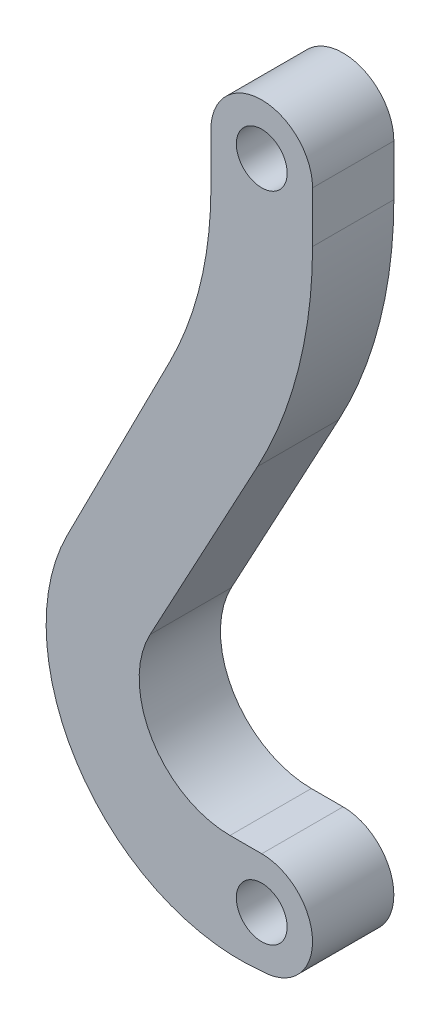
ISO-10303-21;
HEADER;
FILE_DESCRIPTION(('STEP AP214'),'2;1');
FILE_NAME('part.step','',(''),(''),'','','');
FILE_SCHEMA(('AUTOMOTIVE_DESIGN { 1 0 10303 214 1 1 1 1 }'));
ENDSEC;
DATA;
#1=APPLICATION_CONTEXT('core data for automotive mechanical design processes');
#2=APPLICATION_PROTOCOL_DEFINITION('international standard','automotive_design',2000,#1);
#3=PRODUCT_CONTEXT('',#1,'mechanical');
#4=PRODUCT('Part','Part','',(#3));
#5=PRODUCT_RELATED_PRODUCT_CATEGORY('part','',(#4));
#6=PRODUCT_DEFINITION_FORMATION('','',#4);
#7=PRODUCT_DEFINITION_CONTEXT('part definition',#1,'design');
#8=PRODUCT_DEFINITION('design','',#6,#7);
#9=PRODUCT_DEFINITION_SHAPE('','',#8);
#10=(LENGTH_UNIT() NAMED_UNIT(*) SI_UNIT(.MILLI.,.METRE.));
#11=(NAMED_UNIT(*) PLANE_ANGLE_UNIT() SI_UNIT($,.RADIAN.));
#12=(NAMED_UNIT(*) SI_UNIT($,.STERADIAN.) SOLID_ANGLE_UNIT());
#13=UNCERTAINTY_MEASURE_WITH_UNIT(LENGTH_MEASURE(1.E-05),#10,'distance_accuracy_value','');
#14=(GEOMETRIC_REPRESENTATION_CONTEXT(3) GLOBAL_UNCERTAINTY_ASSIGNED_CONTEXT((#13)) GLOBAL_UNIT_ASSIGNED_CONTEXT((#10,
#11,#12)) REPRESENTATION_CONTEXT('',''));
#15=CARTESIAN_POINT('',(0.,0.,0.));
#16=DIRECTION('',(0.,0.,1.));
#17=DIRECTION('',(1.,0.,0.));
#18=AXIS2_PLACEMENT_3D('',#15,#16,#17);
#19=CARTESIAN_POINT('',(1.,12.85,1.6));
#20=DIRECTION('',(0.,0.,-1.));
#21=DIRECTION('',(-1.,0.,0.));
#22=AXIS2_PLACEMENT_3D('',#19,#20,#21);
#23=PLANE('',#22);
#24=CARTESIAN_POINT('',(1.,12.85,1.6));
#25=DIRECTION('',(0.,0.,1.));
#26=DIRECTION('',(1.,0.,0.));
#27=AXIS2_PLACEMENT_3D('',#24,#25,#26);
#28=CIRCLE('',#27,0.500000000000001);
#29=CARTESIAN_POINT('',(1.5,12.85,1.6));
#30=VERTEX_POINT('',#29);
#31=EDGE_CURVE('E153',#30,#30,#28,.T.);
#32=ORIENTED_EDGE('',*,*,#31,.F.);
#33=EDGE_LOOP('',(#32));
#34=FACE_BOUND('',#33,.T.);
#35=CARTESIAN_POINT('',(1.,12.85,1.6));
#36=DIRECTION('',(0.,0.,1.));
#37=DIRECTION('',(-1.,0.,0.));
#38=AXIS2_PLACEMENT_3D('',#35,#36,#37);
#39=CIRCLE('',#38,1.);
#40=CARTESIAN_POINT('',(2.,12.85,1.6));
#41=VERTEX_POINT('',#40);
#42=CARTESIAN_POINT('',(0.,12.85,1.6));
#43=VERTEX_POINT('',#42);
#44=EDGE_CURVE('E170',#41,#43,#39,.T.);
#45=ORIENTED_EDGE('',*,*,#44,.T.);
#46=DIRECTION('',(0.,-1.,0.));
#47=VECTOR('',#46,1.);
#48=CARTESIAN_POINT('',(0.,12.85,1.6));
#49=LINE('',#48,#47);
#50=CARTESIAN_POINT('',(0.,11.8491991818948,1.6));
#51=VERTEX_POINT('',#50);
#52=EDGE_CURVE('E103',#43,#51,#49,.T.);
#53=ORIENTED_EDGE('',*,*,#52,.T.);
#54=CARTESIAN_POINT('',(-7.41008545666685,11.8491991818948,1.6));
#55=DIRECTION('',(0.,0.,-1.));
#56=DIRECTION('',(-1.,0.,0.));
#57=AXIS2_PLACEMENT_3D('',#54,#55,#56);
#58=CIRCLE('',#57,7.41008545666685);
#59=CARTESIAN_POINT('',(-0.806454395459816,8.48744022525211,1.6));
#60=VERTEX_POINT('',#59);
#61=EDGE_CURVE('E194',#51,#60,#58,.T.);
#62=ORIENTED_EDGE('',*,*,#61,.T.);
#63=DIRECTION('',(-0.453673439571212,-0.891168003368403,0.));
#64=VECTOR('',#63,1.);
#65=CARTESIAN_POINT('',(-0.806454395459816,8.48744022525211,1.6));
#66=LINE('',#65,#64);
#67=CARTESIAN_POINT('',(-2.82824737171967,4.5159553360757,1.6));
#68=VERTEX_POINT('',#67);
#69=EDGE_CURVE('E213',#60,#68,#66,.T.);
#70=ORIENTED_EDGE('',*,*,#69,.T.);
#71=CARTESIAN_POINT('',(0.568319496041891,2.7868400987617,1.6));
#72=DIRECTION('',(0.,0.,1.));
#73=DIRECTION('',(1.,0.,0.));
#74=AXIS2_PLACEMENT_3D('',#71,#72,#73);
#75=CIRCLE('',#74,3.81136537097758);
#76=CARTESIAN_POINT('',(1.,-1.,1.6));
#77=VERTEX_POINT('',#76);
#78=EDGE_CURVE('E210',#68,#77,#75,.T.);
#79=ORIENTED_EDGE('',*,*,#78,.T.);
#80=CARTESIAN_POINT('',(1.,0.,1.6));
#81=DIRECTION('',(0.,0.,1.));
#82=DIRECTION('',(-1.,0.,0.));
#83=AXIS2_PLACEMENT_3D('',#80,#81,#82);
#84=CIRCLE('',#83,1.);
#85=CARTESIAN_POINT('',(1.,1.,1.6));
#86=VERTEX_POINT('',#85);
#87=EDGE_CURVE('E212',#77,#86,#84,.T.);
#88=ORIENTED_EDGE('',*,*,#87,.T.);
#89=DIRECTION('',(-1.,0.,0.));
#90=VECTOR('',#89,1.);
#91=CARTESIAN_POINT('',(0.375706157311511,1.,1.6));
#92=LINE('',#91,#90);
#93=CARTESIAN_POINT('',(0.37570615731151,1.,1.6));
#94=VERTEX_POINT('',#93);
#95=EDGE_CURVE('E215',#86,#94,#92,.T.);
#96=ORIENTED_EDGE('',*,*,#95,.T.);
#97=CARTESIAN_POINT('',(0.375706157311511,2.78807330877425,1.6));
#98=DIRECTION('',(0.,0.,-1.));
#99=DIRECTION('',(1.,0.,0.));
#100=AXIS2_PLACEMENT_3D('',#97,#98,#99);
#101=CIRCLE('',#100,1.78807330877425);
#102=CARTESIAN_POINT('',(-1.19809162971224,3.63681748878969,1.6));
#103=VERTEX_POINT('',#102);
#104=EDGE_CURVE('E131',#94,#103,#101,.T.);
#105=ORIENTED_EDGE('',*,*,#104,.T.);
#106=DIRECTION('',(0.474669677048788,0.880164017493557,0.));
#107=VECTOR('',#106,1.);
#108=CARTESIAN_POINT('',(0.916676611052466,7.55816111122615,1.6));
#109=LINE('',#108,#107);
#110=CARTESIAN_POINT('',(0.916676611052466,7.55816111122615,1.6));
#111=VERTEX_POINT('',#110);
#112=EDGE_CURVE('E125',#103,#111,#109,.T.);
#113=ORIENTED_EDGE('',*,*,#112,.T.);
#114=CARTESIAN_POINT('',(-7.04005096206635,11.8491991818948,1.6));
#115=DIRECTION('',(0.,0.,1.));
#116=DIRECTION('',(-1.,0.,0.));
#117=AXIS2_PLACEMENT_3D('',#114,#115,#116);
#118=CIRCLE('',#117,9.04005096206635);
#119=CARTESIAN_POINT('',(2.,11.8491991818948,1.6));
#120=VERTEX_POINT('',#119);
#121=EDGE_CURVE('E129',#111,#120,#118,.T.);
#122=ORIENTED_EDGE('',*,*,#121,.T.);
#123=DIRECTION('',(0.,1.,0.));
#124=VECTOR('',#123,1.);
#125=CARTESIAN_POINT('',(2.,12.85,1.6));
#126=LINE('',#125,#124);
#127=EDGE_CURVE('E51',#120,#41,#126,.T.);
#128=ORIENTED_EDGE('',*,*,#127,.T.);
#129=EDGE_LOOP('',(#45,#53,#62,#70,#79,#88,#96,#105,#113,#122,#128));
#130=FACE_BOUND('',#129,.T.);
#131=CARTESIAN_POINT('',(1.,0.,1.6));
#132=DIRECTION('',(0.,0.,1.));
#133=DIRECTION('',(1.,0.,0.));
#134=AXIS2_PLACEMENT_3D('',#131,#132,#133);
#135=CIRCLE('',#134,0.5);
#136=CARTESIAN_POINT('',(1.5,0.,1.6));
#137=VERTEX_POINT('',#136);
#138=EDGE_CURVE('E261',#137,#137,#135,.T.);
#139=ORIENTED_EDGE('',*,*,#138,.F.);
#140=EDGE_LOOP('',(#139));
#141=FACE_BOUND('',#140,.T.);
#142=ADVANCED_FACE('F34',(#34,#130,#141),#23,.F.);
#143=CARTESIAN_POINT('',(1.,12.85,0.));
#144=DIRECTION('',(0.,0.,-1.));
#145=DIRECTION('',(-1.,0.,0.));
#146=AXIS2_PLACEMENT_3D('',#143,#144,#145);
#147=PLANE('',#146);
#148=CARTESIAN_POINT('',(1.,12.85,0.));
#149=DIRECTION('',(0.,0.,1.));
#150=DIRECTION('',(1.,0.,0.));
#151=AXIS2_PLACEMENT_3D('',#148,#149,#150);
#152=CIRCLE('',#151,0.500000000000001);
#153=CARTESIAN_POINT('',(1.5,12.85,0.));
#154=VERTEX_POINT('',#153);
#155=EDGE_CURVE('E266',#154,#154,#152,.T.);
#156=ORIENTED_EDGE('',*,*,#155,.T.);
#157=EDGE_LOOP('',(#156));
#158=FACE_BOUND('',#157,.T.);
#159=CARTESIAN_POINT('',(1.,12.85,0.));
#160=DIRECTION('',(0.,0.,1.));
#161=DIRECTION('',(-1.,0.,0.));
#162=AXIS2_PLACEMENT_3D('',#159,#160,#161);
#163=CIRCLE('',#162,1.);
#164=CARTESIAN_POINT('',(2.,12.85,0.));
#165=VERTEX_POINT('',#164);
#166=CARTESIAN_POINT('',(0.,12.85,0.));
#167=VERTEX_POINT('',#166);
#168=EDGE_CURVE('E149',#165,#167,#163,.T.);
#169=ORIENTED_EDGE('',*,*,#168,.F.);
#170=DIRECTION('',(0.,1.,0.));
#171=VECTOR('',#170,1.);
#172=CARTESIAN_POINT('',(2.,12.85,0.));
#173=LINE('',#172,#171);
#174=CARTESIAN_POINT('',(2.,11.8491991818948,0.));
#175=VERTEX_POINT('',#174);
#176=EDGE_CURVE('E95',#175,#165,#173,.T.);
#177=ORIENTED_EDGE('',*,*,#176,.F.);
#178=CARTESIAN_POINT('',(-7.04005096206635,11.8491991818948,0.));
#179=DIRECTION('',(0.,0.,1.));
#180=DIRECTION('',(-1.,0.,0.));
#181=AXIS2_PLACEMENT_3D('',#178,#179,#180);
#182=CIRCLE('',#181,9.04005096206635);
#183=CARTESIAN_POINT('',(0.916676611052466,7.55816111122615,0.));
#184=VERTEX_POINT('',#183);
#185=EDGE_CURVE('E89',#184,#175,#182,.T.);
#186=ORIENTED_EDGE('',*,*,#185,.F.);
#187=DIRECTION('',(0.474669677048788,0.880164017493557,0.));
#188=VECTOR('',#187,1.);
#189=CARTESIAN_POINT('',(0.916676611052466,7.55816111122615,0.));
#190=LINE('',#189,#188);
#191=CARTESIAN_POINT('',(-1.19809162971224,3.63681748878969,0.));
#192=VERTEX_POINT('',#191);
#193=EDGE_CURVE('E139',#192,#184,#190,.T.);
#194=ORIENTED_EDGE('',*,*,#193,.F.);
#195=CARTESIAN_POINT('',(0.375706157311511,2.78807330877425,0.));
#196=DIRECTION('',(0.,0.,-1.));
#197=DIRECTION('',(1.,0.,0.));
#198=AXIS2_PLACEMENT_3D('',#195,#196,#197);
#199=CIRCLE('',#198,1.78807330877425);
#200=CARTESIAN_POINT('',(0.37570615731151,1.,0.));
#201=VERTEX_POINT('',#200);
#202=EDGE_CURVE('E165',#201,#192,#199,.T.);
#203=ORIENTED_EDGE('',*,*,#202,.F.);
#204=DIRECTION('',(-1.,0.,0.));
#205=VECTOR('',#204,1.);
#206=CARTESIAN_POINT('',(0.375706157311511,1.,0.));
#207=LINE('',#206,#205);
#208=CARTESIAN_POINT('',(1.,1.,0.));
#209=VERTEX_POINT('',#208);
#210=EDGE_CURVE('E163',#209,#201,#207,.T.);
#211=ORIENTED_EDGE('',*,*,#210,.F.);
#212=CARTESIAN_POINT('',(1.,0.,0.));
#213=DIRECTION('',(0.,0.,1.));
#214=DIRECTION('',(-1.,0.,0.));
#215=AXIS2_PLACEMENT_3D('',#212,#213,#214);
#216=CIRCLE('',#215,1.);
#217=CARTESIAN_POINT('',(1.,-1.,0.));
#218=VERTEX_POINT('',#217);
#219=EDGE_CURVE('E161',#218,#209,#216,.T.);
#220=ORIENTED_EDGE('',*,*,#219,.F.);
#221=CARTESIAN_POINT('',(0.568319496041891,2.7868400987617,0.));
#222=DIRECTION('',(0.,0.,1.));
#223=DIRECTION('',(1.,0.,0.));
#224=AXIS2_PLACEMENT_3D('',#221,#222,#223);
#225=CIRCLE('',#224,3.81136537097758);
#226=CARTESIAN_POINT('',(-2.82824737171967,4.5159553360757,0.));
#227=VERTEX_POINT('',#226);
#228=EDGE_CURVE('E159',#227,#218,#225,.T.);
#229=ORIENTED_EDGE('',*,*,#228,.F.);
#230=DIRECTION('',(-0.453673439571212,-0.891168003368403,0.));
#231=VECTOR('',#230,1.);
#232=CARTESIAN_POINT('',(-0.806454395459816,8.48744022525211,0.));
#233=LINE('',#232,#231);
#234=CARTESIAN_POINT('',(-0.806454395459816,8.48744022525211,0.));
#235=VERTEX_POINT('',#234);
#236=EDGE_CURVE('E157',#235,#227,#233,.T.);
#237=ORIENTED_EDGE('',*,*,#236,.F.);
#238=CARTESIAN_POINT('',(-7.41008545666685,11.8491991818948,0.));
#239=DIRECTION('',(0.,0.,-1.));
#240=DIRECTION('',(-1.,0.,0.));
#241=AXIS2_PLACEMENT_3D('',#238,#239,#240);
#242=CIRCLE('',#241,7.41008545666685);
#243=CARTESIAN_POINT('',(0.,11.8491991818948,0.));
#244=VERTEX_POINT('',#243);
#245=EDGE_CURVE('E155',#244,#235,#242,.T.);
#246=ORIENTED_EDGE('',*,*,#245,.F.);
#247=DIRECTION('',(0.,-1.,0.));
#248=VECTOR('',#247,1.);
#249=CARTESIAN_POINT('',(0.,12.85,0.));
#250=LINE('',#249,#248);
#251=EDGE_CURVE('E152',#167,#244,#250,.T.);
#252=ORIENTED_EDGE('',*,*,#251,.F.);
#253=EDGE_LOOP('',(#169,#177,#186,#194,#203,#211,#220,#229,#237,#246,#252));
#254=FACE_BOUND('',#253,.T.);
#255=CARTESIAN_POINT('',(1.,0.,0.));
#256=DIRECTION('',(0.,0.,1.));
#257=DIRECTION('',(1.,0.,0.));
#258=AXIS2_PLACEMENT_3D('',#255,#256,#257);
#259=CIRCLE('',#258,0.5);
#260=CARTESIAN_POINT('',(1.5,0.,0.));
#261=VERTEX_POINT('',#260);
#262=EDGE_CURVE('E264',#261,#261,#259,.T.);
#263=ORIENTED_EDGE('',*,*,#262,.T.);
#264=EDGE_LOOP('',(#263));
#265=FACE_BOUND('',#264,.T.);
#266=ADVANCED_FACE('F198',(#158,#254,#265),#147,.T.);
#267=CARTESIAN_POINT('',(1.,12.85,1.6));
#268=DIRECTION('',(0.,0.,-1.));
#269=DIRECTION('',(-1.,0.,0.));
#270=AXIS2_PLACEMENT_3D('',#267,#268,#269);
#271=CYLINDRICAL_SURFACE('',#270,1.);
#272=ORIENTED_EDGE('',*,*,#168,.T.);
#273=DIRECTION('',(0.,0.,-1.));
#274=VECTOR('',#273,1.);
#275=CARTESIAN_POINT('',(0.,12.85,1.6));
#276=LINE('',#275,#274);
#277=EDGE_CURVE('E11',#43,#167,#276,.T.);
#278=ORIENTED_EDGE('',*,*,#277,.F.);
#279=ORIENTED_EDGE('',*,*,#44,.F.);
#280=DIRECTION('',(0.,0.,-1.));
#281=VECTOR('',#280,1.);
#282=CARTESIAN_POINT('',(2.,12.85,1.6));
#283=LINE('',#282,#281);
#284=EDGE_CURVE('E145',#41,#165,#283,.T.);
#285=ORIENTED_EDGE('',*,*,#284,.T.);
#286=EDGE_LOOP('',(#272,#278,#279,#285));
#287=FACE_BOUND('',#286,.T.);
#288=ADVANCED_FACE('F36',(#287),#271,.T.);
#289=CARTESIAN_POINT('',(0.,12.85,1.6));
#290=DIRECTION('',(1.,0.,0.));
#291=DIRECTION('',(0.,0.,-1.));
#292=AXIS2_PLACEMENT_3D('',#289,#290,#291);
#293=PLANE('',#292);
#294=ORIENTED_EDGE('',*,*,#251,.T.);
#295=DIRECTION('',(0.,0.,-1.));
#296=VECTOR('',#295,1.);
#297=CARTESIAN_POINT('',(0.,11.8491991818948,1.6));
#298=LINE('',#297,#296);
#299=EDGE_CURVE('E43',#51,#244,#298,.T.);
#300=ORIENTED_EDGE('',*,*,#299,.F.);
#301=ORIENTED_EDGE('',*,*,#52,.F.);
#302=ORIENTED_EDGE('',*,*,#277,.T.);
#303=EDGE_LOOP('',(#294,#300,#301,#302));
#304=FACE_BOUND('',#303,.T.);
#305=ADVANCED_FACE('F349',(#304),#293,.F.);
#306=CARTESIAN_POINT('',(-7.41008545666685,11.8491991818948,1.6));
#307=DIRECTION('',(0.,0.,-1.));
#308=DIRECTION('',(-1.,0.,0.));
#309=AXIS2_PLACEMENT_3D('',#306,#307,#308);
#310=CYLINDRICAL_SURFACE('',#309,7.41008545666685);
#311=ORIENTED_EDGE('',*,*,#245,.T.);
#312=DIRECTION('',(0.,0.,-1.));
#313=VECTOR('',#312,1.);
#314=CARTESIAN_POINT('',(-0.806454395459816,8.48744022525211,1.6));
#315=LINE('',#314,#313);
#316=EDGE_CURVE('E186',#60,#235,#315,.T.);
#317=ORIENTED_EDGE('',*,*,#316,.F.);
#318=ORIENTED_EDGE('',*,*,#61,.F.);
#319=ORIENTED_EDGE('',*,*,#299,.T.);
#320=EDGE_LOOP('',(#311,#317,#318,#319));
#321=FACE_BOUND('',#320,.T.);
#322=ADVANCED_FACE('F192',(#321),#310,.F.);
#323=CARTESIAN_POINT('',(-0.806454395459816,8.48744022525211,1.6));
#324=DIRECTION('',(0.891168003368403,-0.453673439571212,0.));
#325=DIRECTION('',(0.453673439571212,0.891168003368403,0.));
#326=AXIS2_PLACEMENT_3D('',#323,#324,#325);
#327=PLANE('',#326);
#328=ORIENTED_EDGE('',*,*,#236,.T.);
#329=DIRECTION('',(0.,0.,-1.));
#330=VECTOR('',#329,1.);
#331=CARTESIAN_POINT('',(-2.82824737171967,4.5159553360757,1.6));
#332=LINE('',#331,#330);
#333=EDGE_CURVE('E183',#68,#227,#332,.T.);
#334=ORIENTED_EDGE('',*,*,#333,.F.);
#335=ORIENTED_EDGE('',*,*,#69,.F.);
#336=ORIENTED_EDGE('',*,*,#316,.T.);
#337=EDGE_LOOP('',(#328,#334,#335,#336));
#338=FACE_BOUND('',#337,.T.);
#339=ADVANCED_FACE('F204',(#338),#327,.F.);
#340=CARTESIAN_POINT('',(0.568319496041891,2.7868400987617,1.6));
#341=DIRECTION('',(0.,0.,-1.));
#342=DIRECTION('',(-1.,0.,0.));
#343=AXIS2_PLACEMENT_3D('',#340,#341,#342);
#344=CYLINDRICAL_SURFACE('',#343,3.81136537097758);
#345=ORIENTED_EDGE('',*,*,#228,.T.);
#346=DIRECTION('',(0.,0.,-1.));
#347=VECTOR('',#346,1.);
#348=CARTESIAN_POINT('',(1.,-1.,1.6));
#349=LINE('',#348,#347);
#350=EDGE_CURVE('E180',#77,#218,#349,.T.);
#351=ORIENTED_EDGE('',*,*,#350,.F.);
#352=ORIENTED_EDGE('',*,*,#78,.F.);
#353=ORIENTED_EDGE('',*,*,#333,.T.);
#354=EDGE_LOOP('',(#345,#351,#352,#353));
#355=FACE_BOUND('',#354,.T.);
#356=ADVANCED_FACE('F208',(#355),#344,.T.);
#357=CARTESIAN_POINT('',(1.,0.,1.6));
#358=DIRECTION('',(0.,0.,-1.));
#359=DIRECTION('',(-1.,0.,0.));
#360=AXIS2_PLACEMENT_3D('',#357,#358,#359);
#361=CYLINDRICAL_SURFACE('',#360,1.);
#362=ORIENTED_EDGE('',*,*,#219,.T.);
#363=DIRECTION('',(0.,0.,-1.));
#364=VECTOR('',#363,1.);
#365=CARTESIAN_POINT('',(1.,1.,1.6));
#366=LINE('',#365,#364);
#367=EDGE_CURVE('E177',#86,#209,#366,.T.);
#368=ORIENTED_EDGE('',*,*,#367,.F.);
#369=ORIENTED_EDGE('',*,*,#87,.F.);
#370=ORIENTED_EDGE('',*,*,#350,.T.);
#371=EDGE_LOOP('',(#362,#368,#369,#370));
#372=FACE_BOUND('',#371,.T.);
#373=ADVANCED_FACE('F315',(#372),#361,.T.);
#374=CARTESIAN_POINT('',(0.375706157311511,1.,1.6));
#375=DIRECTION('',(0.,-1.,0.));
#376=DIRECTION('',(0.,0.,-1.));
#377=AXIS2_PLACEMENT_3D('',#374,#375,#376);
#378=PLANE('',#377);
#379=ORIENTED_EDGE('',*,*,#210,.T.);
#380=DIRECTION('',(0.,0.,-1.));
#381=VECTOR('',#380,1.);
#382=CARTESIAN_POINT('',(0.37570615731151,1.,1.6));
#383=LINE('',#382,#381);
#384=EDGE_CURVE('E174',#94,#201,#383,.T.);
#385=ORIENTED_EDGE('',*,*,#384,.F.);
#386=ORIENTED_EDGE('',*,*,#95,.F.);
#387=ORIENTED_EDGE('',*,*,#367,.T.);
#388=EDGE_LOOP('',(#379,#385,#386,#387));
#389=FACE_BOUND('',#388,.T.);
#390=ADVANCED_FACE('F224',(#389),#378,.F.);
#391=CARTESIAN_POINT('',(0.375706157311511,2.78807330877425,1.6));
#392=DIRECTION('',(0.,0.,-1.));
#393=DIRECTION('',(-1.,0.,0.));
#394=AXIS2_PLACEMENT_3D('',#391,#392,#393);
#395=CYLINDRICAL_SURFACE('',#394,1.78807330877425);
#396=ORIENTED_EDGE('',*,*,#202,.T.);
#397=DIRECTION('',(0.,0.,-1.));
#398=VECTOR('',#397,1.);
#399=CARTESIAN_POINT('',(-1.19809162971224,3.63681748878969,1.6));
#400=LINE('',#399,#398);
#401=EDGE_CURVE('E140',#103,#192,#400,.T.);
#402=ORIENTED_EDGE('',*,*,#401,.F.);
#403=ORIENTED_EDGE('',*,*,#104,.F.);
#404=ORIENTED_EDGE('',*,*,#384,.T.);
#405=EDGE_LOOP('',(#396,#402,#403,#404));
#406=FACE_BOUND('',#405,.T.);
#407=ADVANCED_FACE('F228',(#406),#395,.F.);
#408=CARTESIAN_POINT('',(0.916676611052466,7.55816111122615,1.6));
#409=DIRECTION('',(-0.880164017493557,0.474669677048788,0.));
#410=DIRECTION('',(-0.474669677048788,-0.880164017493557,0.));
#411=AXIS2_PLACEMENT_3D('',#408,#409,#410);
#412=PLANE('',#411);
#413=ORIENTED_EDGE('',*,*,#193,.T.);
#414=DIRECTION('',(0.,0.,-1.));
#415=VECTOR('',#414,1.);
#416=CARTESIAN_POINT('',(0.916676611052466,7.55816111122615,1.6));
#417=LINE('',#416,#415);
#418=EDGE_CURVE('E136',#111,#184,#417,.T.);
#419=ORIENTED_EDGE('',*,*,#418,.F.);
#420=ORIENTED_EDGE('',*,*,#112,.F.);
#421=ORIENTED_EDGE('',*,*,#401,.T.);
#422=EDGE_LOOP('',(#413,#419,#420,#421));
#423=FACE_BOUND('',#422,.T.);
#424=ADVANCED_FACE('F137',(#423),#412,.F.);
#425=CARTESIAN_POINT('',(-7.04005096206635,11.8491991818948,1.6));
#426=DIRECTION('',(0.,0.,-1.));
#427=DIRECTION('',(-1.,0.,0.));
#428=AXIS2_PLACEMENT_3D('',#425,#426,#427);
#429=CYLINDRICAL_SURFACE('',#428,9.04005096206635);
#430=ORIENTED_EDGE('',*,*,#185,.T.);
#431=DIRECTION('',(0.,0.,-1.));
#432=VECTOR('',#431,1.);
#433=CARTESIAN_POINT('',(2.,11.8491991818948,1.6));
#434=LINE('',#433,#432);
#435=EDGE_CURVE('E141',#120,#175,#434,.T.);
#436=ORIENTED_EDGE('',*,*,#435,.F.);
#437=ORIENTED_EDGE('',*,*,#121,.F.);
#438=ORIENTED_EDGE('',*,*,#418,.T.);
#439=EDGE_LOOP('',(#430,#436,#437,#438));
#440=FACE_BOUND('',#439,.T.);
#441=ADVANCED_FACE('F143',(#440),#429,.T.);
#442=CARTESIAN_POINT('',(2.,12.85,1.6));
#443=DIRECTION('',(-1.,0.,0.));
#444=DIRECTION('',(0.,-1.,0.));
#445=AXIS2_PLACEMENT_3D('',#442,#443,#444);
#446=PLANE('',#445);
#447=ORIENTED_EDGE('',*,*,#176,.T.);
#448=ORIENTED_EDGE('',*,*,#284,.F.);
#449=ORIENTED_EDGE('',*,*,#127,.F.);
#450=ORIENTED_EDGE('',*,*,#435,.T.);
#451=EDGE_LOOP('',(#447,#448,#449,#450));
#452=FACE_BOUND('',#451,.T.);
#453=ADVANCED_FACE('F232',(#452),#446,.F.);
#454=CARTESIAN_POINT('',(1.,12.85,1.6));
#455=DIRECTION('',(0.,0.,-1.));
#456=DIRECTION('',(-1.,0.,0.));
#457=AXIS2_PLACEMENT_3D('',#454,#455,#456);
#458=CYLINDRICAL_SURFACE('',#457,0.500000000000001);
#459=ORIENTED_EDGE('',*,*,#31,.T.);
#460=EDGE_LOOP('',(#459));
#461=FACE_BOUND('',#460,.T.);
#462=ORIENTED_EDGE('',*,*,#155,.F.);
#463=EDGE_LOOP('',(#462));
#464=FACE_BOUND('',#463,.T.);
#465=ADVANCED_FACE('F234',(#461,#464),#458,.F.);
#466=CARTESIAN_POINT('',(1.,0.,1.6));
#467=DIRECTION('',(0.,0.,-1.));
#468=DIRECTION('',(-1.,0.,0.));
#469=AXIS2_PLACEMENT_3D('',#466,#467,#468);
#470=CYLINDRICAL_SURFACE('',#469,0.5);
#471=ORIENTED_EDGE('',*,*,#138,.T.);
#472=EDGE_LOOP('',(#471));
#473=FACE_BOUND('',#472,.T.);
#474=ORIENTED_EDGE('',*,*,#262,.F.);
#475=EDGE_LOOP('',(#474));
#476=FACE_BOUND('',#475,.T.);
#477=ADVANCED_FACE('F240',(#473,#476),#470,.F.);
#478=CLOSED_SHELL('',(#142,#266,#288,#305,#322,#339,#356,#373,#390,#407,#424,#441,#453,#465,#477));
#479=MANIFOLD_SOLID_BREP('B2',#478);
#480=ADVANCED_BREP_SHAPE_REPRESENTATION('',(#18,#479),#14);
#481=SHAPE_DEFINITION_REPRESENTATION(#9,#480);
ENDSEC;
END-ISO-10303-21;
